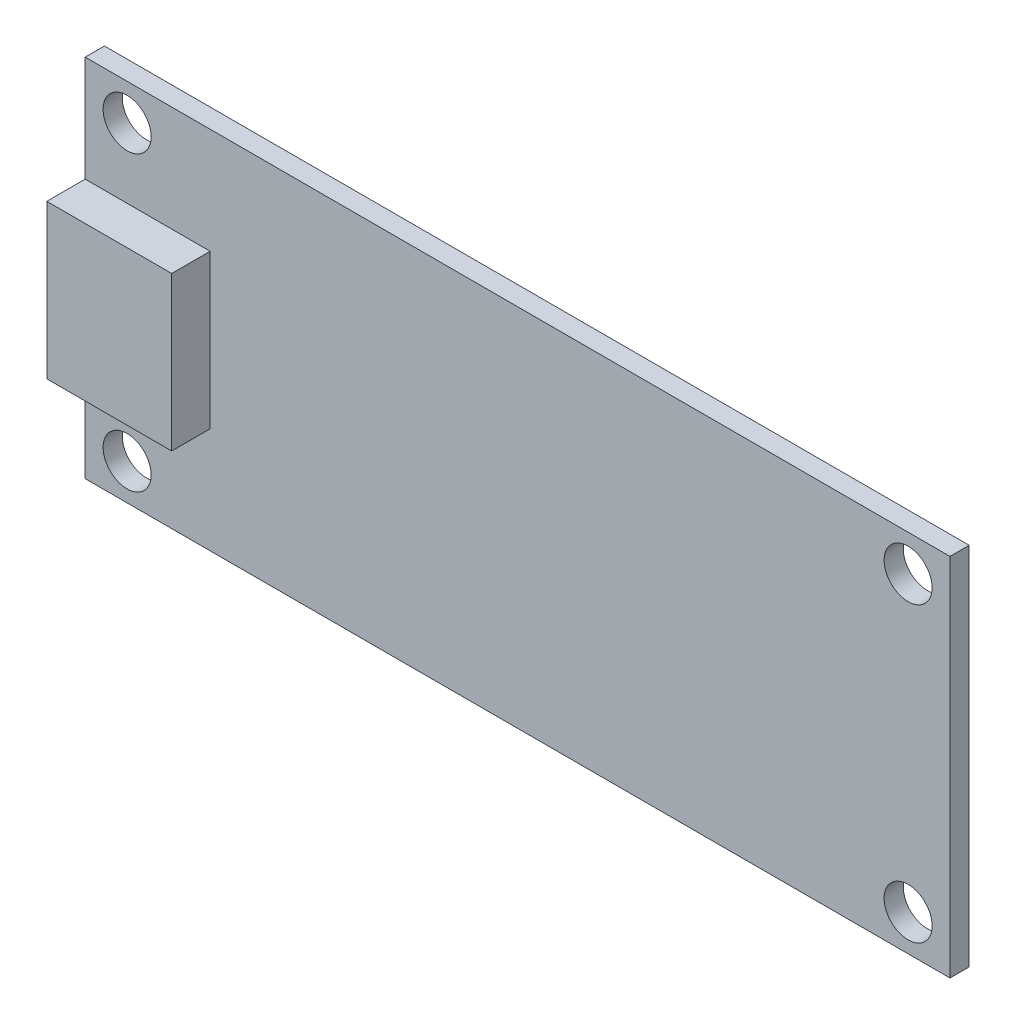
from build123d import *

# Parameters (mm, degrees)
SKETCH1_R           = 1.25
SKETCH1_W           = 6.5
SKETCH1_H           = 8
BOSS_EXTRUDE1_DEPTH = 1
BOSS_EXTRUDE2_START = 1
SKETCH1_3_W         = 6.5
SKETCH1_3_H         = 8
BOSS_EXTRUDE2_DEPTH = 2


with BuildPart() as part:
    # Sketch1 → Boss-Extrude1 (new body)
    # profile 1 of 2: a face of its own
    with BuildSketch(Plane.XY):
        Polygon((-22.5, -4), (-22.5, -9.5), (22.5, -9.5), (22.5, 9.5), (-22.5, 9.5), (-22.5, 4), (-16, 4), (-16, -4), align=None)
        with Locations((-20.32, -7.62)):
            Circle(SKETCH1_R, mode=Mode.SUBTRACT)
        with Locations((20.32, -7.62)):
            Circle(SKETCH1_R, mode=Mode.SUBTRACT)
        with Locations((-20.32, 7.62)):
            Circle(SKETCH1_R, mode=Mode.SUBTRACT)
        with Locations((20.32, 7.62)):
            Circle(SKETCH1_R, mode=Mode.SUBTRACT)
    # profile 2 of 2: a face of its own
    with BuildSketch(Plane.XY):
        with Locations((-19.25, 0)):
            Rectangle(SKETCH1_W, SKETCH1_H)
    extrude(amount=BOSS_EXTRUDE1_DEPTH)

    # Sketch1_3 → Boss-Extrude2 (add)
    with BuildSketch(Plane.XY.offset(BOSS_EXTRUDE2_START)):
        with Locations((-19.25, 0)):
            Rectangle(SKETCH1_3_W, SKETCH1_3_H)
    extrude(amount=BOSS_EXTRUDE2_DEPTH)


solid = part.part
